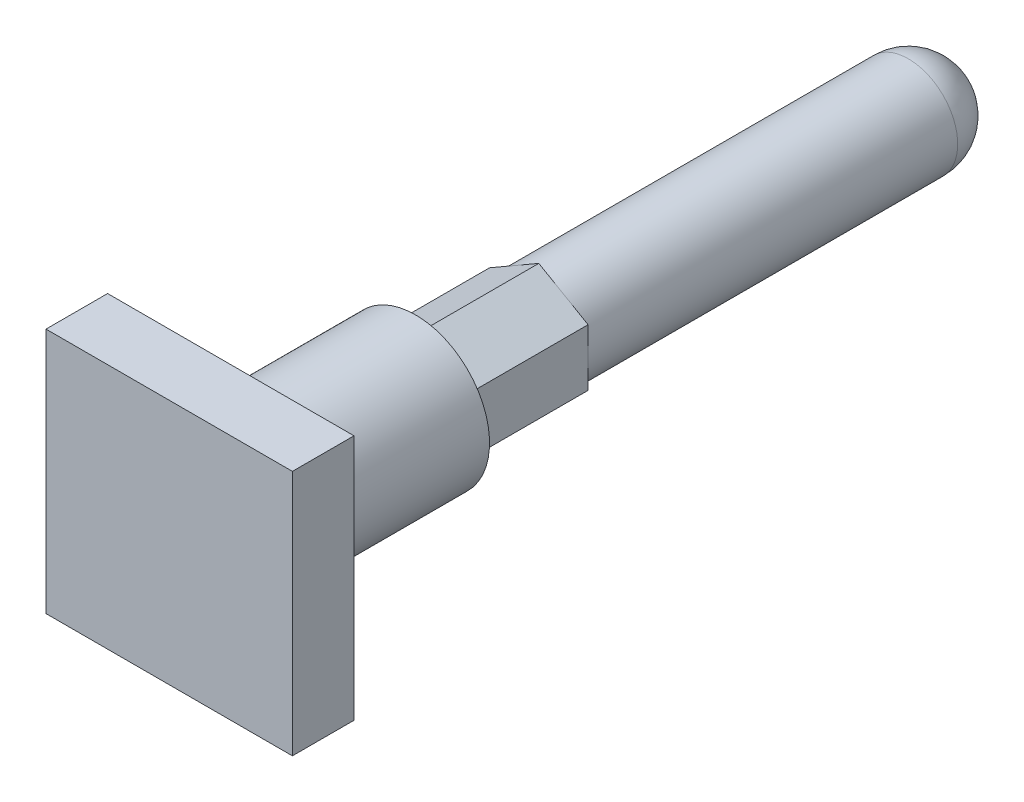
from build123d import *
from build123d.topology import SkipClean

# Parameters (mm, degrees)
SKETCH12_W           = 20
SKETCH12_H           = 20
BOSS_EXTRUDE10_DEPTH = 5
SKETCH13_R           = 6
BOSS_EXTRUDE11_DEPTH = 15
BOSS_EXTRUDE12_DEPTH = 10
SKETCH15_R           = 4
BOSS_EXTRUDE13_DEPTH = 30


with BuildPart() as part:
    # Sketch12 → Boss-Extrude10 (new body)
    with BuildSketch(Plane.XY):
        Rectangle(SKETCH12_W, SKETCH12_H)
    extrude(amount=BOSS_EXTRUDE10_DEPTH)

    # Sketch13 → Boss-Extrude11 (add)
    with BuildSketch(Plane(origin=(0, 0, 0), x_dir=(-1, 0, 0), z_dir=(0, 0, -1))):
        Circle(SKETCH13_R)
    extrude(amount=BOSS_EXTRUDE11_DEPTH)

    # Sketch14 → Boss-Extrude12 (add)
    with BuildSketch(Plane(origin=(0, 0, -15), x_dir=(-1, 0, 0), z_dir=(0, 0, -1))):
        Polygon((4, 2.309401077), (0, 4.618802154), (-4, 2.309401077), (-4, -2.309401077), (0, -4.618802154), (4, -2.309401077), align=None)
    extrude(amount=BOSS_EXTRUDE12_DEPTH)

    # Sketch15 → Boss-Extrude13 (add)
    with BuildSketch(Plane(origin=(0, 0, -25), x_dir=(-1, 0, 0), z_dir=(0, 0, -1))):
        Circle(SKETCH15_R)
    extrude(amount=BOSS_EXTRUDE13_DEPTH)

    # Sketch16 → Revolve2 (revolve)
    with SkipClean():  # the faces are left unmerged after this step: merging them gives an invalid solid
        with BuildSketch(Plane(origin=(0, 0, 0), x_dir=(1, 0, 0), z_dir=(0, 1, 0))):
            with BuildLine():
                Line((4, 55), (-4, 55))
                ThreePointArc((-4, 55), (0, 59), (4, 55))
            make_face()
        revolve(axis=Axis((4, 0, -55), (-1, 0, 0)))


solid = part.part
